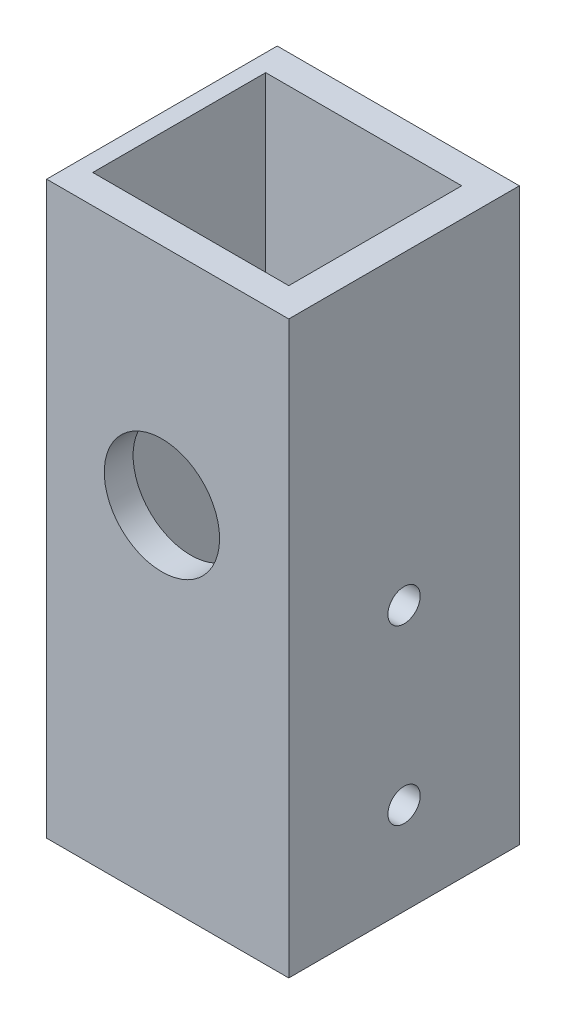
ISO-10303-21;
HEADER;
FILE_DESCRIPTION(('STEP AP214'),'2;1');
FILE_NAME('part.step','',(''),(''),'','','');
FILE_SCHEMA(('AUTOMOTIVE_DESIGN { 1 0 10303 214 1 1 1 1 }'));
ENDSEC;
DATA;
#1=APPLICATION_CONTEXT('core data for automotive mechanical design processes');
#2=APPLICATION_PROTOCOL_DEFINITION('international standard','automotive_design',2000,#1);
#3=PRODUCT_CONTEXT('',#1,'mechanical');
#4=PRODUCT('Part','Part','',(#3));
#5=PRODUCT_RELATED_PRODUCT_CATEGORY('part','',(#4));
#6=PRODUCT_DEFINITION_FORMATION('','',#4);
#7=PRODUCT_DEFINITION_CONTEXT('part definition',#1,'design');
#8=PRODUCT_DEFINITION('design','',#6,#7);
#9=PRODUCT_DEFINITION_SHAPE('','',#8);
#10=(LENGTH_UNIT() NAMED_UNIT(*) SI_UNIT(.MILLI.,.METRE.));
#11=(NAMED_UNIT(*) PLANE_ANGLE_UNIT() SI_UNIT($,.RADIAN.));
#12=(NAMED_UNIT(*) SI_UNIT($,.STERADIAN.) SOLID_ANGLE_UNIT());
#13=UNCERTAINTY_MEASURE_WITH_UNIT(LENGTH_MEASURE(1.E-05),#10,'distance_accuracy_value','');
#14=(GEOMETRIC_REPRESENTATION_CONTEXT(3) GLOBAL_UNCERTAINTY_ASSIGNED_CONTEXT((#13)) GLOBAL_UNIT_ASSIGNED_CONTEXT((#10,
#11,#12)) REPRESENTATION_CONTEXT('',''));
#15=CARTESIAN_POINT('',(0.,0.,0.));
#16=DIRECTION('',(0.,0.,1.));
#17=DIRECTION('',(1.,0.,0.));
#18=AXIS2_PLACEMENT_3D('',#15,#16,#17);
#19=CARTESIAN_POINT('',(-7.5,-30.,3.5));
#20=DIRECTION('',(0.,1.,0.));
#21=DIRECTION('',(0.,0.,1.));
#22=AXIS2_PLACEMENT_3D('',#19,#20,#21);
#23=PLANE('',#22);
#24=DIRECTION('',(-1.,0.,0.));
#25=VECTOR('',#24,1.);
#26=CARTESIAN_POINT('',(-8.49999999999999,-30.,1.));
#27=LINE('',#26,#25);
#28=CARTESIAN_POINT('',(8.5,-30.,1.));
#29=VERTEX_POINT('',#28);
#30=CARTESIAN_POINT('',(-8.49999999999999,-30.,1.));
#31=VERTEX_POINT('',#30);
#32=EDGE_CURVE('E138',#29,#31,#27,.T.);
#33=ORIENTED_EDGE('',*,*,#32,.F.);
#34=DIRECTION('',(0.,0.,1.));
#35=VECTOR('',#34,1.);
#36=CARTESIAN_POINT('',(8.5,-30.,1.));
#37=LINE('',#36,#35);
#38=CARTESIAN_POINT('',(8.5,-30.,-14.));
#39=VERTEX_POINT('',#38);
#40=EDGE_CURVE('E67',#39,#29,#37,.T.);
#41=ORIENTED_EDGE('',*,*,#40,.F.);
#42=DIRECTION('',(1.,0.,0.));
#43=VECTOR('',#42,1.);
#44=CARTESIAN_POINT('',(-8.49999999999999,-30.,-14.));
#45=LINE('',#44,#43);
#46=CARTESIAN_POINT('',(-8.49999999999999,-30.,-14.));
#47=VERTEX_POINT('',#46);
#48=EDGE_CURVE('E144',#47,#39,#45,.T.);
#49=ORIENTED_EDGE('',*,*,#48,.F.);
#50=DIRECTION('',(0.,0.,-1.));
#51=VECTOR('',#50,1.);
#52=CARTESIAN_POINT('',(-8.49999999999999,-30.,1.));
#53=LINE('',#52,#51);
#54=EDGE_CURVE('E141',#31,#47,#53,.T.);
#55=ORIENTED_EDGE('',*,*,#54,.F.);
#56=EDGE_LOOP('',(#33,#41,#49,#55));
#57=FACE_BOUND('',#56,.T.);
#58=DIRECTION('',(1.,0.,0.));
#59=VECTOR('',#58,1.);
#60=CARTESIAN_POINT('',(-7.5,-30.,3.5));
#61=LINE('',#60,#59);
#62=CARTESIAN_POINT('',(-9.99999999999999,-30.,3.5));
#63=VERTEX_POINT('',#62);
#64=CARTESIAN_POINT('',(11.,-30.,3.5));
#65=VERTEX_POINT('',#64);
#66=EDGE_CURVE('E11',#63,#65,#61,.T.);
#67=ORIENTED_EDGE('',*,*,#66,.F.);
#68=DIRECTION('',(0.,0.,-1.));
#69=VECTOR('',#68,1.);
#70=CARTESIAN_POINT('',(-9.99999999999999,-30.,3.5));
#71=LINE('',#70,#69);
#72=CARTESIAN_POINT('',(-9.99999999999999,-30.,-16.5));
#73=VERTEX_POINT('',#72);
#74=EDGE_CURVE('E122',#63,#73,#71,.T.);
#75=ORIENTED_EDGE('',*,*,#74,.T.);
#76=DIRECTION('',(-1.,0.,0.));
#77=VECTOR('',#76,1.);
#78=CARTESIAN_POINT('',(-11.,-30.,-16.5));
#79=LINE('',#78,#77);
#80=CARTESIAN_POINT('',(11.,-30.,-16.5));
#81=VERTEX_POINT('',#80);
#82=EDGE_CURVE('E121',#81,#73,#79,.T.);
#83=ORIENTED_EDGE('',*,*,#82,.F.);
#84=DIRECTION('',(0.,0.,-1.));
#85=VECTOR('',#84,1.);
#86=CARTESIAN_POINT('',(11.,-30.,3.5));
#87=LINE('',#86,#85);
#88=EDGE_CURVE('E51',#65,#81,#87,.T.);
#89=ORIENTED_EDGE('',*,*,#88,.F.);
#90=EDGE_LOOP('',(#67,#75,#83,#89));
#91=FACE_BOUND('',#90,.T.);
#92=ADVANCED_FACE('F43',(#57,#91),#23,.F.);
#93=CARTESIAN_POINT('',(0.,0.,3.5));
#94=DIRECTION('',(0.,0.,-1.));
#95=DIRECTION('',(-1.,0.,0.));
#96=AXIS2_PLACEMENT_3D('',#93,#94,#95);
#97=PLANE('',#96);
#98=CARTESIAN_POINT('',(0.,0.,3.5));
#99=DIRECTION('',(0.,0.,1.));
#100=DIRECTION('',(1.,0.,0.));
#101=AXIS2_PLACEMENT_3D('',#98,#99,#100);
#102=CIRCLE('',#101,5.);
#103=CARTESIAN_POINT('',(4.99999999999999,0.,3.5));
#104=VERTEX_POINT('',#103);
#105=EDGE_CURVE('E129',#104,#104,#102,.T.);
#106=ORIENTED_EDGE('',*,*,#105,.F.);
#107=EDGE_LOOP('',(#106));
#108=FACE_BOUND('',#107,.T.);
#109=DIRECTION('',(1.,0.,0.));
#110=VECTOR('',#109,1.);
#111=CARTESIAN_POINT('',(-11.,19.5,3.5));
#112=LINE('',#111,#110);
#113=CARTESIAN_POINT('',(-9.99999999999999,19.5,3.5));
#114=VERTEX_POINT('',#113);
#115=CARTESIAN_POINT('',(11.,19.5,3.5));
#116=VERTEX_POINT('',#115);
#117=EDGE_CURVE('E133',#114,#116,#112,.T.);
#118=ORIENTED_EDGE('',*,*,#117,.F.);
#119=DIRECTION('',(0.,1.,0.));
#120=VECTOR('',#119,1.);
#121=CARTESIAN_POINT('',(-9.99999999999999,-30.5,3.5));
#122=LINE('',#121,#120);
#123=EDGE_CURVE('E59',#63,#114,#122,.T.);
#124=ORIENTED_EDGE('',*,*,#123,.F.);
#125=ORIENTED_EDGE('',*,*,#66,.T.);
#126=DIRECTION('',(0.,-1.,0.));
#127=VECTOR('',#126,1.);
#128=CARTESIAN_POINT('',(11.,-30.,3.5));
#129=LINE('',#128,#127);
#130=EDGE_CURVE('E168',#116,#65,#129,.T.);
#131=ORIENTED_EDGE('',*,*,#130,.F.);
#132=EDGE_LOOP('',(#118,#124,#125,#131));
#133=FACE_BOUND('',#132,.T.);
#134=ADVANCED_FACE('F193',(#108,#133),#97,.F.);
#135=CARTESIAN_POINT('',(11.,0.,0.));
#136=DIRECTION('',(-1.,0.,0.));
#137=DIRECTION('',(0.,0.,1.));
#138=AXIS2_PLACEMENT_3D('',#135,#136,#137);
#139=PLANE('',#138);
#140=CARTESIAN_POINT('',(11.,-22.,-6.5));
#141=DIRECTION('',(1.,0.,0.));
#142=DIRECTION('',(0.,0.,-1.));
#143=AXIS2_PLACEMENT_3D('',#140,#141,#142);
#144=CIRCLE('',#143,1.4);
#145=CARTESIAN_POINT('',(11.,-22.,-7.9));
#146=VERTEX_POINT('',#145);
#147=EDGE_CURVE('E160',#146,#146,#144,.T.);
#148=ORIENTED_EDGE('',*,*,#147,.F.);
#149=EDGE_LOOP('',(#148));
#150=FACE_BOUND('',#149,.T.);
#151=CARTESIAN_POINT('',(11.,-7.,-6.5));
#152=DIRECTION('',(1.,0.,0.));
#153=DIRECTION('',(0.,0.,-1.));
#154=AXIS2_PLACEMENT_3D('',#151,#152,#153);
#155=CIRCLE('',#154,1.4);
#156=CARTESIAN_POINT('',(11.,-7.,-7.9));
#157=VERTEX_POINT('',#156);
#158=EDGE_CURVE('E159',#157,#157,#155,.T.);
#159=ORIENTED_EDGE('',*,*,#158,.F.);
#160=EDGE_LOOP('',(#159));
#161=FACE_BOUND('',#160,.T.);
#162=ORIENTED_EDGE('',*,*,#130,.T.);
#163=ORIENTED_EDGE('',*,*,#88,.T.);
#164=DIRECTION('',(0.,-1.,0.));
#165=VECTOR('',#164,1.);
#166=CARTESIAN_POINT('',(11.,-30.,-16.5));
#167=LINE('',#166,#165);
#168=CARTESIAN_POINT('',(11.,19.5,-16.5));
#169=VERTEX_POINT('',#168);
#170=EDGE_CURVE('E163',#169,#81,#167,.T.);
#171=ORIENTED_EDGE('',*,*,#170,.F.);
#172=DIRECTION('',(0.,0.,-1.));
#173=VECTOR('',#172,1.);
#174=CARTESIAN_POINT('',(11.,19.5,-16.5));
#175=LINE('',#174,#173);
#176=EDGE_CURVE('E128',#116,#169,#175,.T.);
#177=ORIENTED_EDGE('',*,*,#176,.F.);
#178=EDGE_LOOP('',(#162,#163,#171,#177));
#179=FACE_BOUND('',#178,.T.);
#180=ADVANCED_FACE('F190',(#150,#161,#179),#139,.F.);
#181=CARTESIAN_POINT('',(0.,0.,-16.5));
#182=DIRECTION('',(0.,0.,-1.));
#183=DIRECTION('',(-1.,0.,0.));
#184=AXIS2_PLACEMENT_3D('',#181,#182,#183);
#185=PLANE('',#184);
#186=DIRECTION('',(0.,1.,0.));
#187=VECTOR('',#186,1.);
#188=CARTESIAN_POINT('',(-9.99999999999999,-30.5,-16.5));
#189=LINE('',#188,#187);
#190=CARTESIAN_POINT('',(-9.99999999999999,19.5,-16.5));
#191=VERTEX_POINT('',#190);
#192=EDGE_CURVE('E108',#73,#191,#189,.T.);
#193=ORIENTED_EDGE('',*,*,#192,.T.);
#194=DIRECTION('',(-1.,0.,0.));
#195=VECTOR('',#194,1.);
#196=CARTESIAN_POINT('',(-11.,19.5,-16.5));
#197=LINE('',#196,#195);
#198=EDGE_CURVE('E119',#169,#191,#197,.T.);
#199=ORIENTED_EDGE('',*,*,#198,.F.);
#200=ORIENTED_EDGE('',*,*,#170,.T.);
#201=ORIENTED_EDGE('',*,*,#82,.T.);
#202=EDGE_LOOP('',(#193,#199,#200,#201));
#203=FACE_BOUND('',#202,.T.);
#204=ADVANCED_FACE('F117',(#203),#185,.T.);
#205=CARTESIAN_POINT('',(6.,-7.,-6.5));
#206=DIRECTION('',(1.,0.,0.));
#207=DIRECTION('',(0.,0.,-1.));
#208=AXIS2_PLACEMENT_3D('',#205,#206,#207);
#209=CYLINDRICAL_SURFACE('',#208,1.4);
#210=CARTESIAN_POINT('',(8.5,-7.,-6.5));
#211=DIRECTION('',(1.,0.,0.));
#212=DIRECTION('',(0.,0.,-1.));
#213=AXIS2_PLACEMENT_3D('',#210,#211,#212);
#214=CIRCLE('',#213,1.4);
#215=CARTESIAN_POINT('',(8.5,-7.,-7.9));
#216=VERTEX_POINT('',#215);
#217=EDGE_CURVE('E156',#216,#216,#214,.F.);
#218=ORIENTED_EDGE('',*,*,#217,.T.);
#219=EDGE_LOOP('',(#218));
#220=FACE_BOUND('',#219,.T.);
#221=ORIENTED_EDGE('',*,*,#158,.T.);
#222=EDGE_LOOP('',(#221));
#223=FACE_BOUND('',#222,.T.);
#224=ADVANCED_FACE('F184',(#220,#223),#209,.F.);
#225=CARTESIAN_POINT('',(6.,-22.,-6.5));
#226=DIRECTION('',(1.,0.,0.));
#227=DIRECTION('',(0.,0.,-1.));
#228=AXIS2_PLACEMENT_3D('',#225,#226,#227);
#229=CYLINDRICAL_SURFACE('',#228,1.4);
#230=CARTESIAN_POINT('',(8.5,-22.,-6.5));
#231=DIRECTION('',(1.,0.,0.));
#232=DIRECTION('',(0.,0.,-1.));
#233=AXIS2_PLACEMENT_3D('',#230,#231,#232);
#234=CIRCLE('',#233,1.4);
#235=CARTESIAN_POINT('',(8.5,-22.,-7.9));
#236=VERTEX_POINT('',#235);
#237=EDGE_CURVE('E150',#236,#236,#234,.F.);
#238=ORIENTED_EDGE('',*,*,#237,.T.);
#239=EDGE_LOOP('',(#238));
#240=FACE_BOUND('',#239,.T.);
#241=ORIENTED_EDGE('',*,*,#147,.T.);
#242=EDGE_LOOP('',(#241));
#243=FACE_BOUND('',#242,.T.);
#244=ADVANCED_FACE('F174',(#240,#243),#229,.F.);
#245=CARTESIAN_POINT('',(8.5,20.,1.));
#246=DIRECTION('',(1.,0.,0.));
#247=DIRECTION('',(0.,0.,-1.));
#248=AXIS2_PLACEMENT_3D('',#245,#246,#247);
#249=PLANE('',#248);
#250=DIRECTION('',(0.,-1.,0.));
#251=VECTOR('',#250,1.);
#252=CARTESIAN_POINT('',(8.5,20.,1.));
#253=LINE('',#252,#251);
#254=CARTESIAN_POINT('',(8.5,19.5,1.));
#255=VERTEX_POINT('',#254);
#256=EDGE_CURVE('E147',#255,#29,#253,.T.);
#257=ORIENTED_EDGE('',*,*,#256,.F.);
#258=DIRECTION('',(0.,0.,-1.));
#259=VECTOR('',#258,1.);
#260=CARTESIAN_POINT('',(8.5,19.5,-14.));
#261=LINE('',#260,#259);
#262=CARTESIAN_POINT('',(8.5,19.5,-14.));
#263=VERTEX_POINT('',#262);
#264=EDGE_CURVE('E210',#255,#263,#261,.T.);
#265=ORIENTED_EDGE('',*,*,#264,.T.);
#266=DIRECTION('',(0.,-1.,0.));
#267=VECTOR('',#266,1.);
#268=CARTESIAN_POINT('',(8.5,20.,-14.));
#269=LINE('',#268,#267);
#270=EDGE_CURVE('E148',#263,#39,#269,.T.);
#271=ORIENTED_EDGE('',*,*,#270,.T.);
#272=ORIENTED_EDGE('',*,*,#40,.T.);
#273=EDGE_LOOP('',(#257,#265,#271,#272));
#274=FACE_BOUND('',#273,.T.);
#275=ORIENTED_EDGE('',*,*,#237,.F.);
#276=EDGE_LOOP('',(#275));
#277=FACE_BOUND('',#276,.T.);
#278=ORIENTED_EDGE('',*,*,#217,.F.);
#279=EDGE_LOOP('',(#278));
#280=FACE_BOUND('',#279,.T.);
#281=ADVANCED_FACE('F177',(#274,#277,#280),#249,.F.);
#282=CARTESIAN_POINT('',(-8.49999999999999,20.,-14.));
#283=DIRECTION('',(0.,0.,-1.));
#284=DIRECTION('',(-1.,0.,0.));
#285=AXIS2_PLACEMENT_3D('',#282,#283,#284);
#286=PLANE('',#285);
#287=ORIENTED_EDGE('',*,*,#270,.F.);
#288=DIRECTION('',(-1.,0.,0.));
#289=VECTOR('',#288,1.);
#290=CARTESIAN_POINT('',(-8.49999999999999,19.5,-14.));
#291=LINE('',#290,#289);
#292=CARTESIAN_POINT('',(-8.49999999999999,19.5,-14.));
#293=VERTEX_POINT('',#292);
#294=EDGE_CURVE('E213',#263,#293,#291,.T.);
#295=ORIENTED_EDGE('',*,*,#294,.T.);
#296=DIRECTION('',(0.,-1.,0.));
#297=VECTOR('',#296,1.);
#298=CARTESIAN_POINT('',(-8.49999999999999,20.,-14.));
#299=LINE('',#298,#297);
#300=EDGE_CURVE('E151',#293,#47,#299,.T.);
#301=ORIENTED_EDGE('',*,*,#300,.T.);
#302=ORIENTED_EDGE('',*,*,#48,.T.);
#303=EDGE_LOOP('',(#287,#295,#301,#302));
#304=FACE_BOUND('',#303,.T.);
#305=ADVANCED_FACE('F180',(#304),#286,.F.);
#306=CARTESIAN_POINT('',(-8.49999999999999,20.,1.));
#307=DIRECTION('',(-1.,0.,0.));
#308=DIRECTION('',(0.,0.,1.));
#309=AXIS2_PLACEMENT_3D('',#306,#307,#308);
#310=PLANE('',#309);
#311=ORIENTED_EDGE('',*,*,#300,.F.);
#312=DIRECTION('',(0.,0.,1.));
#313=VECTOR('',#312,1.);
#314=CARTESIAN_POINT('',(-8.49999999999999,19.5,-14.));
#315=LINE('',#314,#313);
#316=CARTESIAN_POINT('',(-8.49999999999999,19.5,1.));
#317=VERTEX_POINT('',#316);
#318=EDGE_CURVE('E201',#293,#317,#315,.T.);
#319=ORIENTED_EDGE('',*,*,#318,.T.);
#320=DIRECTION('',(0.,-1.,0.));
#321=VECTOR('',#320,1.);
#322=CARTESIAN_POINT('',(-8.49999999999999,20.,1.));
#323=LINE('',#322,#321);
#324=EDGE_CURVE('E153',#317,#31,#323,.T.);
#325=ORIENTED_EDGE('',*,*,#324,.T.);
#326=ORIENTED_EDGE('',*,*,#54,.T.);
#327=EDGE_LOOP('',(#311,#319,#325,#326));
#328=FACE_BOUND('',#327,.T.);
#329=ADVANCED_FACE('F221',(#328),#310,.F.);
#330=CARTESIAN_POINT('',(-8.49999999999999,20.,1.));
#331=DIRECTION('',(0.,0.,1.));
#332=DIRECTION('',(1.,0.,0.));
#333=AXIS2_PLACEMENT_3D('',#330,#331,#332);
#334=PLANE('',#333);
#335=CARTESIAN_POINT('',(0.,0.,1.));
#336=DIRECTION('',(0.,0.,1.));
#337=DIRECTION('',(1.,0.,0.));
#338=AXIS2_PLACEMENT_3D('',#335,#336,#337);
#339=CIRCLE('',#338,5.);
#340=CARTESIAN_POINT('',(4.99999999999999,0.,1.));
#341=VERTEX_POINT('',#340);
#342=EDGE_CURVE('E46',#341,#341,#339,.T.);
#343=ORIENTED_EDGE('',*,*,#342,.T.);
#344=EDGE_LOOP('',(#343));
#345=FACE_BOUND('',#344,.T.);
#346=ORIENTED_EDGE('',*,*,#324,.F.);
#347=DIRECTION('',(1.,0.,0.));
#348=VECTOR('',#347,1.);
#349=CARTESIAN_POINT('',(-8.49999999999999,19.5,1.));
#350=LINE('',#349,#348);
#351=EDGE_CURVE('E204',#317,#255,#350,.T.);
#352=ORIENTED_EDGE('',*,*,#351,.T.);
#353=ORIENTED_EDGE('',*,*,#256,.T.);
#354=ORIENTED_EDGE('',*,*,#32,.T.);
#355=EDGE_LOOP('',(#346,#352,#353,#354));
#356=FACE_BOUND('',#355,.T.);
#357=ADVANCED_FACE('F227',(#345,#356),#334,.F.);
#358=CARTESIAN_POINT('',(0.,0.,-6.5));
#359=DIRECTION('',(0.,0.,1.));
#360=DIRECTION('',(1.,0.,0.));
#361=AXIS2_PLACEMENT_3D('',#358,#359,#360);
#362=CYLINDRICAL_SURFACE('',#361,5.);
#363=ORIENTED_EDGE('',*,*,#105,.T.);
#364=EDGE_LOOP('',(#363));
#365=FACE_BOUND('',#364,.T.);
#366=ORIENTED_EDGE('',*,*,#342,.F.);
#367=EDGE_LOOP('',(#366));
#368=FACE_BOUND('',#367,.T.);
#369=ADVANCED_FACE('F229',(#365,#368),#362,.F.);
#370=CARTESIAN_POINT('',(0.,19.5,0.));
#371=DIRECTION('',(0.,1.,0.));
#372=DIRECTION('',(0.,0.,1.));
#373=AXIS2_PLACEMENT_3D('',#370,#371,#372);
#374=PLANE('',#373);
#375=DIRECTION('',(0.,0.,-1.));
#376=VECTOR('',#375,1.);
#377=CARTESIAN_POINT('',(-9.99999999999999,19.5,-16.5));
#378=LINE('',#377,#376);
#379=EDGE_CURVE('E105',#114,#191,#378,.T.);
#380=ORIENTED_EDGE('',*,*,#379,.F.);
#381=ORIENTED_EDGE('',*,*,#117,.T.);
#382=ORIENTED_EDGE('',*,*,#176,.T.);
#383=ORIENTED_EDGE('',*,*,#198,.T.);
#384=EDGE_LOOP('',(#380,#381,#382,#383));
#385=FACE_BOUND('',#384,.T.);
#386=ORIENTED_EDGE('',*,*,#351,.F.);
#387=ORIENTED_EDGE('',*,*,#318,.F.);
#388=ORIENTED_EDGE('',*,*,#294,.F.);
#389=ORIENTED_EDGE('',*,*,#264,.F.);
#390=EDGE_LOOP('',(#386,#387,#388,#389));
#391=FACE_BOUND('',#390,.T.);
#392=ADVANCED_FACE('F125',(#385,#391),#374,.T.);
#393=CARTESIAN_POINT('',(-9.99999999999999,-30.5,-16.5));
#394=DIRECTION('',(1.,0.,0.));
#395=DIRECTION('',(0.,0.,-1.));
#396=AXIS2_PLACEMENT_3D('',#393,#394,#395);
#397=PLANE('',#396);
#398=ORIENTED_EDGE('',*,*,#123,.T.);
#399=ORIENTED_EDGE('',*,*,#379,.T.);
#400=ORIENTED_EDGE('',*,*,#192,.F.);
#401=ORIENTED_EDGE('',*,*,#74,.F.);
#402=EDGE_LOOP('',(#398,#399,#400,#401));
#403=FACE_BOUND('',#402,.T.);
#404=ADVANCED_FACE('F107',(#403),#397,.F.);
#405=CLOSED_SHELL('',(#92,#134,#180,#204,#224,#244,#281,#305,#329,#357,#369,#392,#404));
#406=MANIFOLD_SOLID_BREP('B2',#405);
#407=ADVANCED_BREP_SHAPE_REPRESENTATION('',(#18,#406),#14);
#408=SHAPE_DEFINITION_REPRESENTATION(#9,#407);
ENDSEC;
END-ISO-10303-21;
